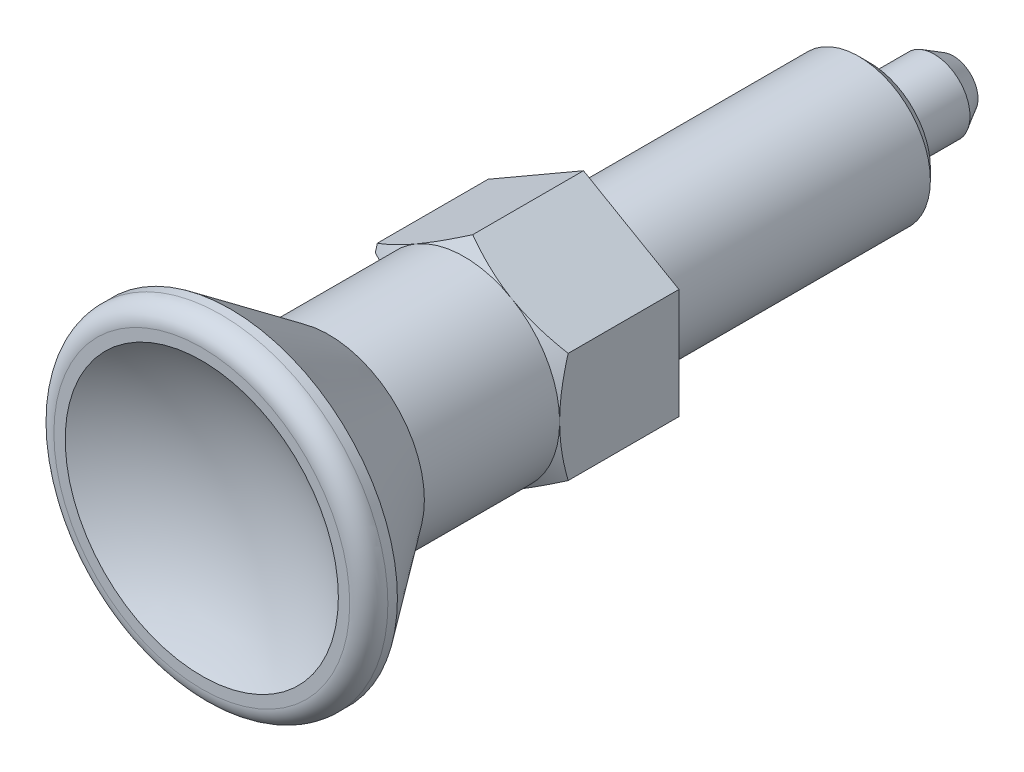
ISO-10303-21;
HEADER;
FILE_DESCRIPTION(('STEP AP214'),'2;1');
FILE_NAME('part.step','',(''),(''),'','','');
FILE_SCHEMA(('AUTOMOTIVE_DESIGN { 1 0 10303 214 1 1 1 1 }'));
ENDSEC;
DATA;
#1=APPLICATION_CONTEXT('core data for automotive mechanical design processes');
#2=APPLICATION_PROTOCOL_DEFINITION('international standard','automotive_design',2000,#1);
#3=PRODUCT_CONTEXT('',#1,'mechanical');
#4=PRODUCT('Part','Part','',(#3));
#5=PRODUCT_RELATED_PRODUCT_CATEGORY('part','',(#4));
#6=PRODUCT_DEFINITION_FORMATION('','',#4);
#7=PRODUCT_DEFINITION_CONTEXT('part definition',#1,'design');
#8=PRODUCT_DEFINITION('design','',#6,#7);
#9=PRODUCT_DEFINITION_SHAPE('','',#8);
#10=(LENGTH_UNIT() NAMED_UNIT(*) SI_UNIT(.MILLI.,.METRE.));
#11=(NAMED_UNIT(*) PLANE_ANGLE_UNIT() SI_UNIT($,.RADIAN.));
#12=(NAMED_UNIT(*) SI_UNIT($,.STERADIAN.) SOLID_ANGLE_UNIT());
#13=UNCERTAINTY_MEASURE_WITH_UNIT(LENGTH_MEASURE(1.E-05),#10,'distance_accuracy_value','');
#14=(GEOMETRIC_REPRESENTATION_CONTEXT(3) GLOBAL_UNCERTAINTY_ASSIGNED_CONTEXT((#13)) GLOBAL_UNIT_ASSIGNED_CONTEXT((#10,
#11,#12)) REPRESENTATION_CONTEXT('',''));
#15=CARTESIAN_POINT('',(0.,0.,0.));
#16=DIRECTION('',(0.,0.,1.));
#17=DIRECTION('',(1.,0.,0.));
#18=AXIS2_PLACEMENT_3D('',#15,#16,#17);
#19=CARTESIAN_POINT('',(-4.,2.30940107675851,5.));
#20=DIRECTION('',(1.,0.,0.));
#21=DIRECTION('',(0.,0.,-1.));
#22=AXIS2_PLACEMENT_3D('',#19,#20,#21);
#23=PLANE('',#22);
#24=DIRECTION('',(0.,-1.,0.));
#25=VECTOR('',#24,1.);
#26=CARTESIAN_POINT('',(-4.,-2.,0.8));
#27=LINE('',#26,#25);
#28=CARTESIAN_POINT('',(-4.,0.,0.8));
#29=VERTEX_POINT('',#28);
#30=CARTESIAN_POINT('',(-4.,-2.,0.8));
#31=VERTEX_POINT('',#30);
#32=EDGE_CURVE('E212',#29,#31,#27,.T.);
#33=ORIENTED_EDGE('',*,*,#32,.F.);
#34=DIRECTION('',(0.,-1.,0.));
#35=VECTOR('',#34,1.);
#36=CARTESIAN_POINT('',(-4.,2.,0.8));
#37=LINE('',#36,#35);
#38=CARTESIAN_POINT('',(-4.,2.,0.8));
#39=VERTEX_POINT('',#38);
#40=EDGE_CURVE('E206',#39,#29,#37,.T.);
#41=ORIENTED_EDGE('',*,*,#40,.F.);
#42=DIRECTION('',(0.,0.,-1.));
#43=VECTOR('',#42,1.);
#44=CARTESIAN_POINT('',(-4.,2.,5.));
#45=LINE('',#44,#43);
#46=CARTESIAN_POINT('',(-4.,2.,4.7274121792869));
#47=VERTEX_POINT('',#46);
#48=EDGE_CURVE('E209',#47,#39,#45,.T.);
#49=ORIENTED_EDGE('',*,*,#48,.F.);
#50=CARTESIAN_POINT('',(-4.,6.94219991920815,2.68359881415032));
#51=CARTESIAN_POINT('',(-4.,6.77603569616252,2.76670980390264));
#52=CARTESIAN_POINT('',(-4.,6.6095814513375,2.8492470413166));
#53=CARTESIAN_POINT('',(-4.,6.27596073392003,3.01289674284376));
#54=CARTESIAN_POINT('',(-4.,6.10879421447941,3.09400911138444));
#55=CARTESIAN_POINT('',(-4.,5.77330106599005,3.25468243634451));
#56=CARTESIAN_POINT('',(-4.,5.60497277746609,3.33423993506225));
#57=CARTESIAN_POINT('',(-4.,5.2673392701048,3.49124950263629));
#58=CARTESIAN_POINT('',(-4.,5.09803407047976,3.56870161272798));
#59=CARTESIAN_POINT('',(-4.,4.75061418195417,3.72444133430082));
#60=CARTESIAN_POINT('',(-4.,4.57244587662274,3.8026097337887));
#61=CARTESIAN_POINT('',(-4.,4.21459047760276,3.95538566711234));
#62=CARTESIAN_POINT('',(-4.,4.03490343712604,4.02999332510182));
#63=CARTESIAN_POINT('',(-4.,3.67381380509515,4.17464945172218));
#64=CARTESIAN_POINT('',(-4.,3.49241227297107,4.24470054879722));
#65=CARTESIAN_POINT('',(-4.,3.12748949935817,4.37901752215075));
#66=CARTESIAN_POINT('',(-4.,2.94396849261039,4.44328403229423));
#67=CARTESIAN_POINT('',(-4.,2.53114564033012,4.5786268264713));
#68=CARTESIAN_POINT('',(-4.,2.30119910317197,4.64776652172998));
#69=CARTESIAN_POINT('',(-4.,1.83716013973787,4.77084277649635));
#70=CARTESIAN_POINT('',(-4.,1.60306808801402,4.8247807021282));
#71=CARTESIAN_POINT('',(-4.,1.25115476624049,4.89049433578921));
#72=CARTESIAN_POINT('',(-4.,1.13472020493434,4.90976469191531));
#73=CARTESIAN_POINT('',(-4.,0.901105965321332,4.94302626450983));
#74=CARTESIAN_POINT('',(-4.,0.783926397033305,4.95701824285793));
#75=CARTESIAN_POINT('',(-4.,0.549056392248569,4.97930439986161));
#76=CARTESIAN_POINT('',(-4.,0.43136611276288,4.98760021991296));
#77=CARTESIAN_POINT('',(-4.,0.195714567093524,4.99823203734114));
#78=CARTESIAN_POINT('',(-4.,0.0777533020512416,5.00056805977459));
#79=CARTESIAN_POINT('',(-4.,-0.158841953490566,4.99919469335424));
#80=CARTESIAN_POINT('',(-4.,-0.277475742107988,4.99544901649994));
#81=CARTESIAN_POINT('',(-4.,-0.514393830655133,4.98197915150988));
#82=CARTESIAN_POINT('',(-4.,-0.632678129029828,4.97225493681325));
#83=CARTESIAN_POINT('',(-4.,-0.986685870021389,4.93453988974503));
#84=CARTESIAN_POINT('',(-4.,-1.22152848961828,4.89800700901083));
#85=CARTESIAN_POINT('',(-4.,-1.69131615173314,4.80535547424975));
#86=CARTESIAN_POINT('',(-4.,-1.92619462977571,4.74891340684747));
#87=CARTESIAN_POINT('',(-4.,-2.39194540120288,4.62119578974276));
#88=CARTESIAN_POINT('',(-4.,-2.62281536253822,4.549911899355));
#89=CARTESIAN_POINT('',(-4.,-3.03218850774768,4.41269957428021));
#90=CARTESIAN_POINT('',(-4.,-3.21140125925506,4.34884828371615));
#91=CARTESIAN_POINT('',(-4.,-3.56777859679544,4.21582911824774));
#92=CARTESIAN_POINT('',(-4.,-3.74494373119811,4.14666270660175));
#93=CARTESIAN_POINT('',(-4.,-4.09769114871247,4.00409177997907));
#94=CARTESIAN_POINT('',(-4.,-4.27327226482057,3.93068439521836));
#95=CARTESIAN_POINT('',(-4.,-4.62300750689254,3.78054235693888));
#96=CARTESIAN_POINT('',(-4.,-4.79716158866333,3.70380760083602));
#97=CARTESIAN_POINT('',(-4.,-5.13693923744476,3.55097532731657));
#98=CARTESIAN_POINT('',(-4.,-5.30261242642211,3.47498778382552));
#99=CARTESIAN_POINT('',(-4.,-5.63302677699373,3.32102277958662));
#100=CARTESIAN_POINT('',(-4.,-5.7977679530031,3.24304534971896));
#101=CARTESIAN_POINT('',(-4.,-6.12617341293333,3.08559440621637));
#102=CARTESIAN_POINT('',(-4.,-6.28983908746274,3.00612378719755));
#103=CARTESIAN_POINT('',(-4.,-6.61649594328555,2.84581872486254));
#104=CARTESIAN_POINT('',(-4.,-6.77948714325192,2.76498431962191));
#105=CARTESIAN_POINT('',(-4.,-6.94219991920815,2.68359881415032));
#106=B_SPLINE_CURVE_WITH_KNOTS('',3,(#50,#51,#52,#53,#54,#55,#56,#57,#58,#59,#60,#61,#62,#63,
#64,#65,#66,#67,#68,#69,#70,#71,#72,#73,#74,#75,#76,#77,#78,#79,#80,#81,#82,#83,#84,#85,#86,#87,
#88,#89,#90,#91,#92,#93,#94,#95,#96,#97,#98,#99,#100,#101,#102,#103,#104,#105),.UNSPECIFIED.,
.F.,.F.,(4,2,2,2,2,2,2,2,2,2,2,2,2,2,2,2,2,2,2,2,2,2,2,2,2,2,2,4),(0.,0.557373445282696,
1.11478413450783,1.67331868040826,2.23184227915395,2.81549662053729,3.39913059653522,
3.98242486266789,4.56565513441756,5.28563913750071,6.00555841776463,6.35951289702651,
6.71341626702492,7.06721761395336,7.42101747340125,7.77693613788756,8.13285638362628,
8.84480341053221,9.56889286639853,10.2933903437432,10.8640406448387,11.4345344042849,
12.005418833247,12.5763208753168,13.123110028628,13.6698907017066,14.215702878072,
14.7614998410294),.UNSPECIFIED.);
#107=CARTESIAN_POINT('',(-4.,2.30940107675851,4.64273441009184));
#108=VERTEX_POINT('',#107);
#109=EDGE_CURVE('E774',#108,#47,#106,.T.);
#110=ORIENTED_EDGE('',*,*,#109,.F.);
#111=DIRECTION('',(0.,0.,-1.));
#112=VECTOR('',#111,1.);
#113=CARTESIAN_POINT('',(-4.,2.30940107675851,5.));
#114=LINE('',#113,#112);
#115=CARTESIAN_POINT('',(-4.,2.30940107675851,0.));
#116=VERTEX_POINT('',#115);
#117=EDGE_CURVE('E735',#108,#116,#114,.T.);
#118=ORIENTED_EDGE('',*,*,#117,.T.);
#119=DIRECTION('',(0.,-1.,0.));
#120=VECTOR('',#119,1.);
#121=CARTESIAN_POINT('',(-4.,2.30940107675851,0.));
#122=LINE('',#121,#120);
#123=CARTESIAN_POINT('',(-4.,-2.30940107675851,0.));
#124=VERTEX_POINT('',#123);
#125=EDGE_CURVE('E706',#116,#124,#122,.T.);
#126=ORIENTED_EDGE('',*,*,#125,.T.);
#127=DIRECTION('',(0.,0.,-1.));
#128=VECTOR('',#127,1.);
#129=CARTESIAN_POINT('',(-4.,-2.30940107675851,5.));
#130=LINE('',#129,#128);
#131=CARTESIAN_POINT('',(-4.,-2.30940107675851,4.64273441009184));
#132=VERTEX_POINT('',#131);
#133=EDGE_CURVE('E732',#132,#124,#130,.T.);
#134=ORIENTED_EDGE('',*,*,#133,.F.);
#135=CARTESIAN_POINT('',(-4.,-2.,4.7274121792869));
#136=VERTEX_POINT('',#135);
#137=EDGE_CURVE('E292',#136,#132,#106,.T.);
#138=ORIENTED_EDGE('',*,*,#137,.F.);
#139=DIRECTION('',(0.,0.,1.));
#140=VECTOR('',#139,1.);
#141=CARTESIAN_POINT('',(-4.,-2.,5.));
#142=LINE('',#141,#140);
#143=EDGE_CURVE('E792',#31,#136,#142,.T.);
#144=ORIENTED_EDGE('',*,*,#143,.F.);
#145=EDGE_LOOP('',(#33,#41,#49,#110,#118,#126,#134,#138,#144));
#146=FACE_BOUND('',#145,.T.);
#147=ADVANCED_FACE('F16',(#146),#23,.F.);
#148=CARTESIAN_POINT('',(0.,0.,5.));
#149=DIRECTION('',(0.,0.,-1.));
#150=DIRECTION('',(-1.,0.,0.));
#151=AXIS2_PLACEMENT_3D('',#148,#149,#150);
#152=CONICAL_SURFACE('',#151,4.,1.0471975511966);
#153=CARTESIAN_POINT('',(-5.63960193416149,-2.,3.85468883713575));
#154=CARTESIAN_POINT('',(-5.44305552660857,-2.,3.96160040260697));
#155=CARTESIAN_POINT('',(-5.24627466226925,-2.,4.0680876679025));
#156=CARTESIAN_POINT('',(-4.85207699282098,-2.,4.27970429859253));
#157=CARTESIAN_POINT('',(-4.65466044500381,-2.,4.38483414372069));
#158=CARTESIAN_POINT('',(-4.25951074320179,-2.,4.59297377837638));
#159=CARTESIAN_POINT('',(-4.06178058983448,-2.,4.69598924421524));
#160=CARTESIAN_POINT('',(-3.66490811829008,-2.,4.89947675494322));
#161=CARTESIAN_POINT('',(-3.46576524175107,-2.,4.99994771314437));
#162=CARTESIAN_POINT('',(-3.0646119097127,-2.,5.19747364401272));
#163=CARTESIAN_POINT('',(-2.86259239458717,-2.,5.2945104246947));
#164=CARTESIAN_POINT('',(-2.55746435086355,-2.,5.43528371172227));
#165=CARTESIAN_POINT('',(-2.45545220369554,-2.,5.4813912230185));
#166=CARTESIAN_POINT('',(-2.25052354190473,-2.,5.57154461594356));
#167=CARTESIAN_POINT('',(-2.14760707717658,-2.,5.61559061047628));
#168=CARTESIAN_POINT('',(-1.94022174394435,-2.,5.70117457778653));
#169=CARTESIAN_POINT('',(-1.83574816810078,-2.,5.74270122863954));
#170=CARTESIAN_POINT('',(-1.62547380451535,-2.,5.82213860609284));
#171=CARTESIAN_POINT('',(-1.51967355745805,-2.,5.86005075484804));
#172=CARTESIAN_POINT('',(-1.3060831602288,-2.,5.93121414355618));
#173=CARTESIAN_POINT('',(-1.19828749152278,-2.,5.9644491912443));
#174=CARTESIAN_POINT('',(-0.980778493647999,-2.,6.02450323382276));
#175=CARTESIAN_POINT('',(-0.871062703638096,-2.,6.05131323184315));
#176=CARTESIAN_POINT('',(-0.760398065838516,-2.,6.07405966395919));
#177=B_SPLINE_CURVE_WITH_KNOTS('',3,(#153,#154,#155,#156,#157,#158,#159,#160,#161,#162,#163,
#164,#165,#166,#167,#168,#169,#170,#171,#172,#173,#174,#175,#176),.UNSPECIFIED.,.F.,.F.,(4,2,2,
2,2,2,2,2,2,2,2,4),(0.,0.671230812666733,1.34221752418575,2.01107158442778,2.68020663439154,
3.35247394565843,3.68830146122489,4.02411056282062,4.36133137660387,4.69841895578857,
5.036646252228,5.37534442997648),.UNSPECIFIED.);
#178=CARTESIAN_POINT('',(-3.46410161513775,-2.,5.));
#179=VERTEX_POINT('',#178);
#180=EDGE_CURVE('E10',#136,#179,#177,.T.);
#181=ORIENTED_EDGE('',*,*,#180,.F.);
#182=ORIENTED_EDGE('',*,*,#137,.T.);
#183=CARTESIAN_POINT('',(-4.0002,-2.30928560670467,4.64266774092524));
#184=CARTESIAN_POINT('',(-3.82442084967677,-2.41077174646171,4.70128212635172));
#185=CARTESIAN_POINT('',(-3.64712438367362,-2.513133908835,4.75458967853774));
#186=CARTESIAN_POINT('',(-3.28946140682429,-2.71963072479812,4.84763832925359));
#187=CARTESIAN_POINT('',(-3.10908854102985,-2.82376904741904,4.8873465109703));
#188=CARTESIAN_POINT('',(-2.75057818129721,-3.03075510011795,4.94915778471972));
#189=CARTESIAN_POINT('',(-2.57249584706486,-3.13357098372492,4.97167226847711));
#190=CARTESIAN_POINT('',(-2.2154932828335,-3.33968651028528,4.99854937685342));
#191=CARTESIAN_POINT('',(-2.0365743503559,-3.44298540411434,5.00293425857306));
#192=CARTESIAN_POINT('',(-1.70225715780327,-3.63600352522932,4.99380992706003));
#193=CARTESIAN_POINT('',(-1.54680884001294,-3.72575165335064,4.98254104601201));
#194=CARTESIAN_POINT('',(-1.23692494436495,-3.90466320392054,4.94682600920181));
#195=CARTESIAN_POINT('',(-1.08249043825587,-3.99382600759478,4.92236765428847));
#196=CARTESIAN_POINT('',(-0.771967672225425,-4.17310641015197,4.86122393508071));
#197=CARTESIAN_POINT('',(-0.6159187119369,-4.26320131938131,4.82427939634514));
#198=CARTESIAN_POINT('',(-0.306148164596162,-4.4420474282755,4.74042992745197));
#199=CARTESIAN_POINT('',(-0.152422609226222,-4.53080091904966,4.69354469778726));
#200=CARTESIAN_POINT('',(0.000199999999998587,-4.61891762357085,4.64266774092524));
#201=B_SPLINE_CURVE_WITH_KNOTS('',3,(#183,#184,#185,#186,#187,#188,#189,#190,#191,#192,#193,
#194,#195,#196,#197,#198,#199,#200),.UNSPECIFIED.,.F.,.F.,(4,2,2,2,2,2,2,2,4),(0.,
0.634047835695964,1.26961969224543,1.88946157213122,2.50854226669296,3.04757825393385,
3.58711366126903,4.13861653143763,4.68903648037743),.UNSPECIFIED.);
#202=CARTESIAN_POINT('',(-2.,-3.46410161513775,5.));
#203=VERTEX_POINT('',#202);
#204=EDGE_CURVE('E778',#132,#203,#201,.T.);
#205=ORIENTED_EDGE('',*,*,#204,.T.);
#206=CARTESIAN_POINT('',(0.,0.,5.));
#207=DIRECTION('',(0.,0.,1.));
#208=DIRECTION('',(1.,0.,0.));
#209=AXIS2_PLACEMENT_3D('',#206,#207,#208);
#210=CIRCLE('',#209,4.);
#211=EDGE_CURVE('E751',#179,#203,#210,.T.);
#212=ORIENTED_EDGE('',*,*,#211,.F.);
#213=EDGE_LOOP('',(#181,#182,#205,#212));
#214=FACE_BOUND('',#213,.T.);
#215=ADVANCED_FACE('F275',(#214),#152,.T.);
#216=CARTESIAN_POINT('',(-0.760398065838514,2.,6.07405966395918));
#217=CARTESIAN_POINT('',(-0.852479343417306,2.,6.05515117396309));
#218=CARTESIAN_POINT('',(-0.943918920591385,2.,6.03340322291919));
#219=CARTESIAN_POINT('',(-1.12547581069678,2.,5.98524543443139));
#220=CARTESIAN_POINT('',(-1.21559432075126,2.,5.95884014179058));
#221=CARTESIAN_POINT('',(-1.39438815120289,2.,5.9024263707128));
#222=CARTESIAN_POINT('',(-1.48306690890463,2.,5.87242860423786));
#223=CARTESIAN_POINT('',(-1.65940941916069,2.,5.80952958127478));
#224=CARTESIAN_POINT('',(-1.74707288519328,2.,5.77662752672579));
#225=CARTESIAN_POINT('',(-2.00804397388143,2.,5.67480303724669));
#226=CARTESIAN_POINT('',(-2.18003823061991,2.,5.60252807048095));
#227=CARTESIAN_POINT('',(-2.52166053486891,2.,5.45228888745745));
#228=CARTESIAN_POINT('',(-2.69128630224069,2.,5.37431958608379));
#229=CARTESIAN_POINT('',(-2.97769282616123,2.,5.23880174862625));
#230=CARTESIAN_POINT('',(-3.09493070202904,2.,5.18221419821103));
#231=CARTESIAN_POINT('',(-3.3287174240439,2.,5.06763479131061));
#232=CARTESIAN_POINT('',(-3.44526626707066,2.,5.009642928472));
#233=CARTESIAN_POINT('',(-3.79401368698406,2.,4.83409044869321));
#234=CARTESIAN_POINT('',(-4.02539708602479,2.,4.71491262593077));
#235=CARTESIAN_POINT('',(-4.48779393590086,2.,4.47328422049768));
#236=CARTESIAN_POINT('',(-4.71880080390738,2.,4.35082111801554));
#237=CARTESIAN_POINT('',(-5.06458306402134,2.,4.16572193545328));
#238=CARTESIAN_POINT('',(-5.1797323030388,2.,4.10378275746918));
#239=CARTESIAN_POINT('',(-5.40981749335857,2.,3.97951214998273));
#240=CARTESIAN_POINT('',(-5.52475344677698,2.,3.91718072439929));
#241=CARTESIAN_POINT('',(-5.63960193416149,2.,3.85468883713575));
#242=B_SPLINE_CURVE_WITH_KNOTS('',3,(#216,#217,#218,#219,#220,#221,#222,#223,#224,#225,#226,
#227,#228,#229,#230,#231,#232,#233,#234,#235,#236,#237,#238,#239,#240,#241),.UNSPECIFIED.,.F.,
.F.,(4,2,2,2,2,2,2,2,2,2,2,2,4),(0.,0.281880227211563,0.563486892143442,0.844273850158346,
1.12513820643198,1.68463880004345,2.24464529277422,2.63517472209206,3.02570591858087,
3.8064890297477,4.59085905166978,4.98311122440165,5.37535948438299),.UNSPECIFIED.);
#243=CARTESIAN_POINT('',(-3.46410161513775,2.,5.));
#244=VERTEX_POINT('',#243);
#245=EDGE_CURVE('E31',#244,#47,#242,.T.);
#246=ORIENTED_EDGE('',*,*,#245,.F.);
#247=CARTESIAN_POINT('',(-2.,3.46410161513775,5.));
#248=VERTEX_POINT('',#247);
#249=EDGE_CURVE('E431',#248,#244,#210,.T.);
#250=ORIENTED_EDGE('',*,*,#249,.F.);
#251=CARTESIAN_POINT('',(0.0002000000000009,4.61891762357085,4.64266774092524));
#252=CARTESIAN_POINT('',(-0.175579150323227,4.51743148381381,4.70128212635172));
#253=CARTESIAN_POINT('',(-0.35287561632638,4.41506932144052,4.75458967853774));
#254=CARTESIAN_POINT('',(-0.710538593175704,4.2085725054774,4.84763832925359));
#255=CARTESIAN_POINT('',(-0.890911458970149,4.10443418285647,4.88734651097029));
#256=CARTESIAN_POINT('',(-1.24942181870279,3.89744813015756,4.94915778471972));
#257=CARTESIAN_POINT('',(-1.42750415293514,3.7946322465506,4.97167226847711));
#258=CARTESIAN_POINT('',(-1.78450671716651,3.58851671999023,4.99854937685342));
#259=CARTESIAN_POINT('',(-1.9634256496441,3.48521782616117,5.00293425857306));
#260=CARTESIAN_POINT('',(-2.29774284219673,3.29219970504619,4.99380992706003));
#261=CARTESIAN_POINT('',(-2.45319115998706,3.20245157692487,4.98254104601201));
#262=CARTESIAN_POINT('',(-2.76307505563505,3.02354002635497,4.94682600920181));
#263=CARTESIAN_POINT('',(-2.91750956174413,2.93437722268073,4.92236765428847));
#264=CARTESIAN_POINT('',(-3.22803232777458,2.75509682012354,4.86122393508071));
#265=CARTESIAN_POINT('',(-3.3840812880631,2.6650019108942,4.82427939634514));
#266=CARTESIAN_POINT('',(-3.69385183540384,2.48615580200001,4.74042992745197));
#267=CARTESIAN_POINT('',(-3.84757739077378,2.39740231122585,4.69354469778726));
#268=CARTESIAN_POINT('',(-4.0002,2.30928560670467,4.64266774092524));
#269=B_SPLINE_CURVE_WITH_KNOTS('',3,(#251,#252,#253,#254,#255,#256,#257,#258,#259,#260,#261,
#262,#263,#264,#265,#266,#267,#268),.UNSPECIFIED.,.F.,.F.,(4,2,2,2,2,2,2,2,4),(0.,
0.634047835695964,1.26961969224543,1.88946157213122,2.50854226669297,3.04757825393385,
3.58711366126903,4.13861653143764,4.68903648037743),.UNSPECIFIED.);
#270=EDGE_CURVE('E300',#248,#108,#269,.T.);
#271=ORIENTED_EDGE('',*,*,#270,.T.);
#272=ORIENTED_EDGE('',*,*,#109,.T.);
#273=EDGE_LOOP('',(#246,#250,#271,#272));
#274=FACE_BOUND('',#273,.T.);
#275=ADVANCED_FACE('F377',(#274),#152,.T.);
#276=CARTESIAN_POINT('',(4.,2.30940107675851,5.));
#277=DIRECTION('',(-0.5,-0.866025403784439,0.));
#278=DIRECTION('',(0.866025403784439,-0.5,0.));
#279=AXIS2_PLACEMENT_3D('',#276,#277,#278);
#280=PLANE('',#279);
#281=CARTESIAN_POINT('',(4.0002,2.30928560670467,4.64266774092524));
#282=CARTESIAN_POINT('',(3.82442084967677,2.41077174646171,4.70128212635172));
#283=CARTESIAN_POINT('',(3.64712438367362,2.513133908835,4.75458967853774));
#284=CARTESIAN_POINT('',(3.28946140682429,2.71963072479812,4.84763832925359));
#285=CARTESIAN_POINT('',(3.10908854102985,2.82376904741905,4.8873465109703));
#286=CARTESIAN_POINT('',(2.75057818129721,3.03075510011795,4.94915778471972));
#287=CARTESIAN_POINT('',(2.57249584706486,3.13357098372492,4.97167226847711));
#288=CARTESIAN_POINT('',(2.21549328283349,3.33968651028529,4.99854937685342));
#289=CARTESIAN_POINT('',(2.0365743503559,3.44298540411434,5.00293425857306));
#290=CARTESIAN_POINT('',(1.70225715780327,3.63600352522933,4.99380992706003));
#291=CARTESIAN_POINT('',(1.54680884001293,3.72575165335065,4.98254104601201));
#292=CARTESIAN_POINT('',(1.23692494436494,3.90466320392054,4.94682600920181));
#293=CARTESIAN_POINT('',(1.08249043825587,3.99382600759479,4.92236765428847));
#294=CARTESIAN_POINT('',(0.771967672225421,4.17310641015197,4.86122393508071));
#295=CARTESIAN_POINT('',(0.615918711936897,4.26320131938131,4.82427939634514));
#296=CARTESIAN_POINT('',(0.30614816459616,4.44204742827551,4.74042992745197));
#297=CARTESIAN_POINT('',(0.152422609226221,4.53080091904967,4.69354469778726));
#298=CARTESIAN_POINT('',(-0.000199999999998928,4.61891762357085,4.64266774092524));
#299=B_SPLINE_CURVE_WITH_KNOTS('',3,(#281,#282,#283,#284,#285,#286,#287,#288,#289,#290,#291,
#292,#293,#294,#295,#296,#297,#298),.UNSPECIFIED.,.F.,.F.,(4,2,2,2,2,2,2,2,4),(0.,
0.634047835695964,1.26961969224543,1.88946157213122,2.50854226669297,3.04757825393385,
3.58711366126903,4.13861653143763,4.68903648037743),.UNSPECIFIED.);
#300=CARTESIAN_POINT('',(4.,2.30940107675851,4.64273441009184));
#301=VERTEX_POINT('',#300);
#302=CARTESIAN_POINT('',(2.,3.46410161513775,5.));
#303=VERTEX_POINT('',#302);
#304=EDGE_CURVE('E704',#301,#303,#299,.T.);
#305=ORIENTED_EDGE('',*,*,#304,.F.);
#306=DIRECTION('',(0.,0.,-1.));
#307=VECTOR('',#306,1.);
#308=CARTESIAN_POINT('',(4.,2.30940107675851,5.));
#309=LINE('',#308,#307);
#310=CARTESIAN_POINT('',(4.,2.30940107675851,0.));
#311=VERTEX_POINT('',#310);
#312=EDGE_CURVE('E724',#301,#311,#309,.T.);
#313=ORIENTED_EDGE('',*,*,#312,.T.);
#314=DIRECTION('',(-0.866025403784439,0.5,0.));
#315=VECTOR('',#314,1.);
#316=CARTESIAN_POINT('',(4.,2.30940107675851,0.));
#317=LINE('',#316,#315);
#318=CARTESIAN_POINT('',(0.,4.61880215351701,0.));
#319=VERTEX_POINT('',#318);
#320=EDGE_CURVE('E695',#311,#319,#317,.T.);
#321=ORIENTED_EDGE('',*,*,#320,.T.);
#322=DIRECTION('',(0.,0.,-1.));
#323=VECTOR('',#322,1.);
#324=CARTESIAN_POINT('',(0.,4.61880215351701,5.));
#325=LINE('',#324,#323);
#326=CARTESIAN_POINT('',(0.,4.61880215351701,4.64273441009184));
#327=VERTEX_POINT('',#326);
#328=EDGE_CURVE('E738',#327,#319,#325,.T.);
#329=ORIENTED_EDGE('',*,*,#328,.F.);
#330=EDGE_CURVE('E307',#303,#327,#299,.T.);
#331=ORIENTED_EDGE('',*,*,#330,.F.);
#332=EDGE_LOOP('',(#305,#313,#321,#329,#331));
#333=FACE_BOUND('',#332,.T.);
#334=ADVANCED_FACE('F386',(#333),#280,.F.);
#335=CARTESIAN_POINT('',(0.,4.61880215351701,5.));
#336=DIRECTION('',(0.5,-0.866025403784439,0.));
#337=DIRECTION('',(0.866025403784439,0.5,0.));
#338=AXIS2_PLACEMENT_3D('',#335,#336,#337);
#339=PLANE('',#338);
#340=EDGE_CURVE('E772',#327,#248,#269,.T.);
#341=ORIENTED_EDGE('',*,*,#340,.F.);
#342=ORIENTED_EDGE('',*,*,#328,.T.);
#343=DIRECTION('',(-0.866025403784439,-0.5,0.));
#344=VECTOR('',#343,1.);
#345=CARTESIAN_POINT('',(0.,4.61880215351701,0.));
#346=LINE('',#345,#344);
#347=EDGE_CURVE('E701',#319,#116,#346,.T.);
#348=ORIENTED_EDGE('',*,*,#347,.T.);
#349=ORIENTED_EDGE('',*,*,#117,.F.);
#350=ORIENTED_EDGE('',*,*,#270,.F.);
#351=EDGE_LOOP('',(#341,#342,#348,#349,#350));
#352=FACE_BOUND('',#351,.T.);
#353=ADVANCED_FACE('F383',(#352),#339,.F.);
#354=CARTESIAN_POINT('',(-4.,-2.30940107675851,5.));
#355=DIRECTION('',(0.5,0.866025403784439,0.));
#356=DIRECTION('',(-0.866025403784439,0.5,0.));
#357=AXIS2_PLACEMENT_3D('',#354,#355,#356);
#358=PLANE('',#357);
#359=ORIENTED_EDGE('',*,*,#204,.F.);
#360=ORIENTED_EDGE('',*,*,#133,.T.);
#361=DIRECTION('',(0.866025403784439,-0.5,0.));
#362=VECTOR('',#361,1.);
#363=CARTESIAN_POINT('',(-4.,-2.30940107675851,0.));
#364=LINE('',#363,#362);
#365=CARTESIAN_POINT('',(0.,-4.61880215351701,0.));
#366=VERTEX_POINT('',#365);
#367=EDGE_CURVE('E714',#124,#366,#364,.T.);
#368=ORIENTED_EDGE('',*,*,#367,.T.);
#369=DIRECTION('',(0.,0.,-1.));
#370=VECTOR('',#369,1.);
#371=CARTESIAN_POINT('',(0.,-4.61880215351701,5.));
#372=LINE('',#371,#370);
#373=CARTESIAN_POINT('',(0.,-4.61880215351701,4.64273441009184));
#374=VERTEX_POINT('',#373);
#375=EDGE_CURVE('E729',#374,#366,#372,.T.);
#376=ORIENTED_EDGE('',*,*,#375,.F.);
#377=EDGE_CURVE('E284',#203,#374,#201,.T.);
#378=ORIENTED_EDGE('',*,*,#377,.F.);
#379=EDGE_LOOP('',(#359,#360,#368,#376,#378));
#380=FACE_BOUND('',#379,.T.);
#381=ADVANCED_FACE('F381',(#380),#358,.F.);
#382=CARTESIAN_POINT('',(0.,-4.61880215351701,5.));
#383=DIRECTION('',(-0.5,0.866025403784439,0.));
#384=DIRECTION('',(-0.866025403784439,-0.5,0.));
#385=AXIS2_PLACEMENT_3D('',#382,#383,#384);
#386=PLANE('',#385);
#387=CARTESIAN_POINT('',(-0.000200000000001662,-4.61891762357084,4.64266774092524));
#388=CARTESIAN_POINT('',(0.175579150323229,-4.5174314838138,4.70128212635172));
#389=CARTESIAN_POINT('',(0.352875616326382,-4.41506932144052,4.75458967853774));
#390=CARTESIAN_POINT('',(0.710538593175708,-4.2085725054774,4.84763832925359));
#391=CARTESIAN_POINT('',(0.890911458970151,-4.10443418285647,4.88734651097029));
#392=CARTESIAN_POINT('',(1.24942181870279,-3.89744813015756,4.94915778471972));
#393=CARTESIAN_POINT('',(1.42750415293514,-3.7946322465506,4.97167226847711));
#394=CARTESIAN_POINT('',(1.78450671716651,-3.58851671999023,4.99854937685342));
#395=CARTESIAN_POINT('',(1.9634256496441,-3.48521782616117,5.00293425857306));
#396=CARTESIAN_POINT('',(2.29774284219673,-3.29219970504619,4.99380992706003));
#397=CARTESIAN_POINT('',(2.45319115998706,-3.20245157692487,4.98254104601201));
#398=CARTESIAN_POINT('',(2.76307505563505,-3.02354002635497,4.94682600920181));
#399=CARTESIAN_POINT('',(2.91750956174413,-2.93437722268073,4.92236765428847));
#400=CARTESIAN_POINT('',(3.22803232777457,-2.75509682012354,4.86122393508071));
#401=CARTESIAN_POINT('',(3.3840812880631,-2.6650019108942,4.82427939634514));
#402=CARTESIAN_POINT('',(3.69385183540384,-2.48615580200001,4.74042992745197));
#403=CARTESIAN_POINT('',(3.84757739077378,-2.39740231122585,4.69354469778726));
#404=CARTESIAN_POINT('',(4.0002,-2.30928560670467,4.64266774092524));
#405=B_SPLINE_CURVE_WITH_KNOTS('',3,(#387,#388,#389,#390,#391,#392,#393,#394,#395,#396,#397,
#398,#399,#400,#401,#402,#403,#404),.UNSPECIFIED.,.F.,.F.,(4,2,2,2,2,2,2,2,4),(0.,
0.634047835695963,1.26961969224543,1.88946157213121,2.50854226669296,3.04757825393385,
3.58711366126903,4.13861653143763,4.68903648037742),.UNSPECIFIED.);
#406=CARTESIAN_POINT('',(2.,-3.46410161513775,5.));
#407=VERTEX_POINT('',#406);
#408=EDGE_CURVE('E783',#374,#407,#405,.T.);
#409=ORIENTED_EDGE('',*,*,#408,.F.);
#410=ORIENTED_EDGE('',*,*,#375,.T.);
#411=DIRECTION('',(0.866025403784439,0.5,0.));
#412=VECTOR('',#411,1.);
#413=CARTESIAN_POINT('',(0.,-4.61880215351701,0.));
#414=LINE('',#413,#412);
#415=CARTESIAN_POINT('',(4.,-2.30940107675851,0.));
#416=VERTEX_POINT('',#415);
#417=EDGE_CURVE('E718',#366,#416,#414,.T.);
#418=ORIENTED_EDGE('',*,*,#417,.T.);
#419=DIRECTION('',(0.,0.,-1.));
#420=VECTOR('',#419,1.);
#421=CARTESIAN_POINT('',(4.,-2.30940107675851,5.));
#422=LINE('',#421,#420);
#423=CARTESIAN_POINT('',(4.,-2.30940107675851,4.64273441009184));
#424=VERTEX_POINT('',#423);
#425=EDGE_CURVE('E726',#424,#416,#422,.T.);
#426=ORIENTED_EDGE('',*,*,#425,.F.);
#427=EDGE_CURVE('E258',#407,#424,#405,.T.);
#428=ORIENTED_EDGE('',*,*,#427,.F.);
#429=EDGE_LOOP('',(#409,#410,#418,#426,#428));
#430=FACE_BOUND('',#429,.T.);
#431=ADVANCED_FACE('F576',(#430),#386,.F.);
#432=CARTESIAN_POINT('',(4.,-2.30940107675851,5.));
#433=DIRECTION('',(-1.,0.,0.));
#434=DIRECTION('',(0.,0.,1.));
#435=AXIS2_PLACEMENT_3D('',#432,#433,#434);
#436=PLANE('',#435);
#437=CARTESIAN_POINT('',(4.,-6.94219991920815,2.68359881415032));
#438=CARTESIAN_POINT('',(4.,-6.77603569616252,2.76670980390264));
#439=CARTESIAN_POINT('',(4.,-6.6095814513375,2.8492470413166));
#440=CARTESIAN_POINT('',(4.,-6.27596073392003,3.01289674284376));
#441=CARTESIAN_POINT('',(4.,-6.10879421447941,3.09400911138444));
#442=CARTESIAN_POINT('',(4.,-5.77330106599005,3.25468243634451));
#443=CARTESIAN_POINT('',(4.,-5.60497277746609,3.33423993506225));
#444=CARTESIAN_POINT('',(4.,-5.2673392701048,3.49124950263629));
#445=CARTESIAN_POINT('',(4.,-5.09803407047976,3.56870161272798));
#446=CARTESIAN_POINT('',(4.,-4.75061418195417,3.72444133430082));
#447=CARTESIAN_POINT('',(4.,-4.57244587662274,3.80260973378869));
#448=CARTESIAN_POINT('',(4.,-4.21459047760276,3.95538566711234));
#449=CARTESIAN_POINT('',(4.,-4.03490343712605,4.02999332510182));
#450=CARTESIAN_POINT('',(4.,-3.67381380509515,4.17464945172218));
#451=CARTESIAN_POINT('',(4.,-3.49241227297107,4.24470054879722));
#452=CARTESIAN_POINT('',(4.,-3.12748949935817,4.37901752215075));
#453=CARTESIAN_POINT('',(4.,-2.94396849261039,4.44328403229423));
#454=CARTESIAN_POINT('',(4.,-2.53114564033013,4.5786268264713));
#455=CARTESIAN_POINT('',(4.,-2.30119910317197,4.64776652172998));
#456=CARTESIAN_POINT('',(4.,-1.83716013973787,4.77084277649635));
#457=CARTESIAN_POINT('',(4.,-1.60306808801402,4.8247807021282));
#458=CARTESIAN_POINT('',(4.,-1.2511547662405,4.89049433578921));
#459=CARTESIAN_POINT('',(4.,-1.13472020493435,4.90976469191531));
#460=CARTESIAN_POINT('',(4.,-0.901105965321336,4.94302626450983));
#461=CARTESIAN_POINT('',(4.,-0.783926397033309,4.95701824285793));
#462=CARTESIAN_POINT('',(4.,-0.549056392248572,4.97930439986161));
#463=CARTESIAN_POINT('',(4.,-0.431366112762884,4.98760021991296));
#464=CARTESIAN_POINT('',(4.,-0.195714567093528,4.99823203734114));
#465=CARTESIAN_POINT('',(4.,-0.077753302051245,5.00056805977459));
#466=CARTESIAN_POINT('',(4.,0.158841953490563,4.99919469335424));
#467=CARTESIAN_POINT('',(4.,0.277475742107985,4.99544901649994));
#468=CARTESIAN_POINT('',(4.,0.514393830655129,4.98197915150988));
#469=CARTESIAN_POINT('',(4.,0.632678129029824,4.97225493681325));
#470=CARTESIAN_POINT('',(4.,0.986685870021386,4.93453988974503));
#471=CARTESIAN_POINT('',(4.,1.22152848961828,4.89800700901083));
#472=CARTESIAN_POINT('',(4.,1.69131615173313,4.80535547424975));
#473=CARTESIAN_POINT('',(4.,1.9261946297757,4.74891340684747));
#474=CARTESIAN_POINT('',(4.,2.39194540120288,4.62119578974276));
#475=CARTESIAN_POINT('',(4.,2.62281536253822,4.549911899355));
#476=CARTESIAN_POINT('',(4.,3.03218850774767,4.41269957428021));
#477=CARTESIAN_POINT('',(4.,3.21140125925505,4.34884828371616));
#478=CARTESIAN_POINT('',(4.,3.56777859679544,4.21582911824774));
#479=CARTESIAN_POINT('',(4.,3.74494373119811,4.14666270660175));
#480=CARTESIAN_POINT('',(4.,4.09769114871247,4.00409177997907));
#481=CARTESIAN_POINT('',(4.,4.27327226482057,3.93068439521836));
#482=CARTESIAN_POINT('',(4.,4.62300750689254,3.78054235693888));
#483=CARTESIAN_POINT('',(4.,4.79716158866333,3.70380760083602));
#484=CARTESIAN_POINT('',(4.,5.13693923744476,3.55097532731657));
#485=CARTESIAN_POINT('',(4.,5.3026124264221,3.47498778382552));
#486=CARTESIAN_POINT('',(4.,5.63302677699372,3.32102277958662));
#487=CARTESIAN_POINT('',(4.,5.7977679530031,3.24304534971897));
#488=CARTESIAN_POINT('',(4.,6.12617341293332,3.08559440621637));
#489=CARTESIAN_POINT('',(4.,6.28983908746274,3.00612378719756));
#490=CARTESIAN_POINT('',(4.,6.61649594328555,2.84581872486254));
#491=CARTESIAN_POINT('',(4.,6.77948714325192,2.76498431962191));
#492=CARTESIAN_POINT('',(4.,6.94219991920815,2.68359881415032));
#493=B_SPLINE_CURVE_WITH_KNOTS('',3,(#437,#438,#439,#440,#441,#442,#443,#444,#445,#446,#447,
#448,#449,#450,#451,#452,#453,#454,#455,#456,#457,#458,#459,#460,#461,#462,#463,#464,#465,#466,
#467,#468,#469,#470,#471,#472,#473,#474,#475,#476,#477,#478,#479,#480,#481,#482,#483,#484,#485,
#486,#487,#488,#489,#490,#491,#492),.UNSPECIFIED.,.F.,.F.,(4,2,2,2,2,2,2,2,2,2,2,2,2,2,2,2,2,2,
2,2,2,2,2,2,2,2,2,4),(0.,0.557373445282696,1.11478413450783,1.67331868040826,2.23184227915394,
2.81549662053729,3.39913059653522,3.98242486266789,4.56565513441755,5.2856391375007,
6.00555841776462,6.35951289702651,6.71341626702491,7.06721761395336,7.42101747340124,
7.77693613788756,8.13285638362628,8.8448034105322,9.56889286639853,10.2933903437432,
10.8640406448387,11.4345344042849,12.005418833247,12.5763208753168,13.123110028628,
13.6698907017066,14.215702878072,14.7614998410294),.UNSPECIFIED.);
#494=CARTESIAN_POINT('',(4.,0.,5.));
#495=VERTEX_POINT('',#494);
#496=EDGE_CURVE('E45',#424,#495,#493,.T.);
#497=ORIENTED_EDGE('',*,*,#496,.F.);
#498=ORIENTED_EDGE('',*,*,#425,.T.);
#499=DIRECTION('',(0.,1.,0.));
#500=VECTOR('',#499,1.);
#501=CARTESIAN_POINT('',(4.,-2.30940107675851,0.));
#502=LINE('',#501,#500);
#503=EDGE_CURVE('E698',#416,#311,#502,.T.);
#504=ORIENTED_EDGE('',*,*,#503,.T.);
#505=ORIENTED_EDGE('',*,*,#312,.F.);
#506=EDGE_CURVE('E250',#495,#301,#493,.T.);
#507=ORIENTED_EDGE('',*,*,#506,.F.);
#508=EDGE_LOOP('',(#497,#498,#504,#505,#507));
#509=FACE_BOUND('',#508,.T.);
#510=ADVANCED_FACE('F265',(#509),#436,.F.);
#511=CARTESIAN_POINT('',(-1.5,0.,-12.));
#512=DIRECTION('',(0.,0.,1.));
#513=DIRECTION('',(1.,0.,0.));
#514=AXIS2_PLACEMENT_3D('',#511,#512,#513);
#515=PLANE('',#514);
#516=CARTESIAN_POINT('',(0.,0.,-12.));
#517=DIRECTION('',(0.,0.,1.));
#518=DIRECTION('',(1.,0.,0.));
#519=AXIS2_PLACEMENT_3D('',#516,#517,#518);
#520=CIRCLE('',#519,2.54);
#521=CARTESIAN_POINT('',(2.54,0.,-12.));
#522=VERTEX_POINT('',#521);
#523=EDGE_CURVE('E418',#522,#522,#520,.F.);
#524=ORIENTED_EDGE('',*,*,#523,.T.);
#525=EDGE_LOOP('',(#524));
#526=FACE_BOUND('',#525,.T.);
#527=CARTESIAN_POINT('',(0.,0.,-12.));
#528=DIRECTION('',(0.,0.,1.));
#529=DIRECTION('',(1.,0.,0.));
#530=AXIS2_PLACEMENT_3D('',#527,#528,#529);
#531=CIRCLE('',#530,1.5);
#532=CARTESIAN_POINT('',(1.5,0.,-12.));
#533=VERTEX_POINT('',#532);
#534=EDGE_CURVE('E742',#533,#533,#531,.T.);
#535=ORIENTED_EDGE('',*,*,#534,.T.);
#536=EDGE_LOOP('',(#535));
#537=FACE_BOUND('',#536,.T.);
#538=ADVANCED_FACE('F402',(#526,#537),#515,.F.);
#539=CARTESIAN_POINT('',(0.,0.,0.));
#540=DIRECTION('',(0.,0.,1.));
#541=DIRECTION('',(1.,0.,0.));
#542=AXIS2_PLACEMENT_3D('',#539,#540,#541);
#543=CYLINDRICAL_SURFACE('',#542,1.5);
#544=CARTESIAN_POINT('',(0.,0.,-14.7));
#545=DIRECTION('',(0.,0.,-1.));
#546=DIRECTION('',(-1.,0.,0.));
#547=AXIS2_PLACEMENT_3D('',#544,#545,#546);
#548=CIRCLE('',#547,1.5);
#549=CARTESIAN_POINT('',(-1.5,0.,-14.7));
#550=VERTEX_POINT('',#549);
#551=EDGE_CURVE('E235',#550,#550,#548,.T.);
#552=ORIENTED_EDGE('',*,*,#551,.F.);
#553=EDGE_LOOP('',(#552));
#554=FACE_BOUND('',#553,.T.);
#555=ORIENTED_EDGE('',*,*,#534,.F.);
#556=EDGE_LOOP('',(#555));
#557=FACE_BOUND('',#556,.T.);
#558=ADVANCED_FACE('F395',(#554,#557),#543,.T.);
#559=CARTESIAN_POINT('',(0.,0.,0.));
#560=DIRECTION('',(0.,0.,1.));
#561=DIRECTION('',(1.,0.,0.));
#562=AXIS2_PLACEMENT_3D('',#559,#560,#561);
#563=CYLINDRICAL_SURFACE('',#562,3.);
#564=CARTESIAN_POINT('',(0.,0.,-11.54));
#565=DIRECTION('',(0.,0.,1.));
#566=DIRECTION('',(1.,0.,0.));
#567=AXIS2_PLACEMENT_3D('',#564,#565,#566);
#568=CIRCLE('',#567,3.);
#569=CARTESIAN_POINT('',(3.,0.,-11.54));
#570=VERTEX_POINT('',#569);
#571=EDGE_CURVE('E421',#570,#570,#568,.T.);
#572=ORIENTED_EDGE('',*,*,#571,.T.);
#573=EDGE_LOOP('',(#572));
#574=FACE_BOUND('',#573,.T.);
#575=CARTESIAN_POINT('',(0.,0.,0.));
#576=DIRECTION('',(0.,0.,1.));
#577=DIRECTION('',(1.,0.,0.));
#578=AXIS2_PLACEMENT_3D('',#575,#576,#577);
#579=CIRCLE('',#578,3.);
#580=CARTESIAN_POINT('',(3.,0.,0.));
#581=VERTEX_POINT('',#580);
#582=EDGE_CURVE('E690',#581,#581,#579,.T.);
#583=ORIENTED_EDGE('',*,*,#582,.F.);
#584=EDGE_LOOP('',(#583));
#585=FACE_BOUND('',#584,.T.);
#586=ADVANCED_FACE('F392',(#574,#585),#563,.T.);
#587=CARTESIAN_POINT('',(0.,0.,0.));
#588=DIRECTION('',(0.,0.,1.));
#589=DIRECTION('',(1.,0.,0.));
#590=AXIS2_PLACEMENT_3D('',#587,#588,#589);
#591=PLANE('',#590);
#592=ORIENTED_EDGE('',*,*,#582,.T.);
#593=EDGE_LOOP('',(#592));
#594=FACE_BOUND('',#593,.T.);
#595=ORIENTED_EDGE('',*,*,#320,.F.);
#596=ORIENTED_EDGE('',*,*,#503,.F.);
#597=ORIENTED_EDGE('',*,*,#417,.F.);
#598=ORIENTED_EDGE('',*,*,#367,.F.);
#599=ORIENTED_EDGE('',*,*,#125,.F.);
#600=ORIENTED_EDGE('',*,*,#347,.F.);
#601=EDGE_LOOP('',(#595,#596,#597,#598,#599,#600));
#602=FACE_BOUND('',#601,.T.);
#603=ADVANCED_FACE('F278',(#594,#602),#591,.F.);
#604=ORIENTED_EDGE('',*,*,#427,.T.);
#605=ORIENTED_EDGE('',*,*,#496,.T.);
#606=EDGE_CURVE('E434',#407,#495,#210,.T.);
#607=ORIENTED_EDGE('',*,*,#606,.F.);
#608=EDGE_LOOP('',(#604,#605,#607));
#609=FACE_BOUND('',#608,.T.);
#610=ADVANCED_FACE('F276',(#609),#152,.T.);
#611=ORIENTED_EDGE('',*,*,#377,.T.);
#612=ORIENTED_EDGE('',*,*,#408,.T.);
#613=EDGE_CURVE('E750',#203,#407,#210,.T.);
#614=ORIENTED_EDGE('',*,*,#613,.F.);
#615=EDGE_LOOP('',(#611,#612,#614));
#616=FACE_BOUND('',#615,.T.);
#617=ADVANCED_FACE('F549',(#616),#152,.T.);
#618=ORIENTED_EDGE('',*,*,#330,.T.);
#619=ORIENTED_EDGE('',*,*,#340,.T.);
#620=EDGE_CURVE('E423',#303,#248,#210,.T.);
#621=ORIENTED_EDGE('',*,*,#620,.F.);
#622=EDGE_LOOP('',(#618,#619,#621));
#623=FACE_BOUND('',#622,.T.);
#624=ADVANCED_FACE('F273',(#623),#152,.T.);
#625=ORIENTED_EDGE('',*,*,#304,.T.);
#626=CARTESIAN_POINT('',(0.,0.,5.));
#627=DIRECTION('',(0.,0.,1.));
#628=DIRECTION('',(1.,0.,0.));
#629=AXIS2_PLACEMENT_3D('',#626,#627,#628);
#630=CIRCLE('',#629,4.);
#631=EDGE_CURVE('E247',#495,#303,#630,.T.);
#632=ORIENTED_EDGE('',*,*,#631,.F.);
#633=ORIENTED_EDGE('',*,*,#506,.T.);
#634=EDGE_LOOP('',(#625,#632,#633));
#635=FACE_BOUND('',#634,.T.);
#636=ADVANCED_FACE('F268',(#635),#152,.T.);
#637=CARTESIAN_POINT('',(-7.,0.,16.));
#638=DIRECTION('',(0.,0.,-1.));
#639=DIRECTION('',(-1.,0.,0.));
#640=AXIS2_PLACEMENT_3D('',#637,#638,#639);
#641=PLANE('',#640);
#642=CARTESIAN_POINT('',(0.,0.,16.));
#643=DIRECTION('',(0.,0.,1.));
#644=DIRECTION('',(1.,0.,0.));
#645=AXIS2_PLACEMENT_3D('',#642,#643,#644);
#646=CIRCLE('',#645,5.725);
#647=CARTESIAN_POINT('',(5.725,0.,16.));
#648=VERTEX_POINT('',#647);
#649=EDGE_CURVE('E227',#648,#648,#646,.T.);
#650=ORIENTED_EDGE('',*,*,#649,.F.);
#651=EDGE_LOOP('',(#650));
#652=FACE_BOUND('',#651,.T.);
#653=CARTESIAN_POINT('',(0.,0.,16.));
#654=DIRECTION('',(0.,0.,-1.));
#655=DIRECTION('',(-1.,0.,0.));
#656=AXIS2_PLACEMENT_3D('',#653,#654,#655);
#657=CIRCLE('',#656,6.2);
#658=CARTESIAN_POINT('',(-6.2,0.,16.));
#659=VERTEX_POINT('',#658);
#660=EDGE_CURVE('E428',#659,#659,#657,.F.);
#661=ORIENTED_EDGE('',*,*,#660,.T.);
#662=EDGE_LOOP('',(#661));
#663=FACE_BOUND('',#662,.T.);
#664=ADVANCED_FACE('F272',(#652,#663),#641,.F.);
#665=CARTESIAN_POINT('',(0.,0.,0.));
#666=DIRECTION('',(0.,0.,1.));
#667=DIRECTION('',(1.,0.,0.));
#668=AXIS2_PLACEMENT_3D('',#665,#666,#667);
#669=CYLINDRICAL_SURFACE('',#668,4.);
#670=CARTESIAN_POINT('',(0.,0.,0.8));
#671=DIRECTION('',(0.,0.,-1.));
#672=DIRECTION('',(1.,0.,0.));
#673=AXIS2_PLACEMENT_3D('',#670,#671,#672);
#674=CIRCLE('',#673,4.);
#675=CARTESIAN_POINT('',(-3.62077339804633,1.7,0.8));
#676=VERTEX_POINT('',#675);
#677=EDGE_CURVE('E156',#29,#676,#674,.T.);
#678=ORIENTED_EDGE('',*,*,#677,.F.);
#679=CARTESIAN_POINT('',(-3.62077339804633,-1.7,0.8));
#680=VERTEX_POINT('',#679);
#681=EDGE_CURVE('E149',#680,#29,#674,.T.);
#682=ORIENTED_EDGE('',*,*,#681,.F.);
#683=DIRECTION('',(0.,0.,1.));
#684=VECTOR('',#683,1.);
#685=CARTESIAN_POINT('',(-3.62077339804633,-1.7,0.8));
#686=LINE('',#685,#684);
#687=CARTESIAN_POINT('',(-3.62077339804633,-1.7,5.));
#688=VERTEX_POINT('',#687);
#689=EDGE_CURVE('E154',#680,#688,#686,.T.);
#690=ORIENTED_EDGE('',*,*,#689,.T.);
#691=EDGE_CURVE('E756',#688,#179,#210,.T.);
#692=ORIENTED_EDGE('',*,*,#691,.T.);
#693=ORIENTED_EDGE('',*,*,#211,.T.);
#694=ORIENTED_EDGE('',*,*,#613,.T.);
#695=ORIENTED_EDGE('',*,*,#606,.T.);
#696=ORIENTED_EDGE('',*,*,#631,.T.);
#697=ORIENTED_EDGE('',*,*,#620,.T.);
#698=ORIENTED_EDGE('',*,*,#249,.T.);
#699=CARTESIAN_POINT('',(-3.62077339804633,1.7,5.));
#700=VERTEX_POINT('',#699);
#701=EDGE_CURVE('E433',#244,#700,#210,.T.);
#702=ORIENTED_EDGE('',*,*,#701,.T.);
#703=DIRECTION('',(0.,0.,1.));
#704=VECTOR('',#703,1.);
#705=CARTESIAN_POINT('',(-3.62077339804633,1.7,0.8));
#706=LINE('',#705,#704);
#707=EDGE_CURVE('E170',#676,#700,#706,.T.);
#708=ORIENTED_EDGE('',*,*,#707,.F.);
#709=EDGE_LOOP('',(#678,#682,#690,#692,#693,#694,#695,#696,#697,#698,#702,#708));
#710=FACE_BOUND('',#709,.T.);
#711=CARTESIAN_POINT('',(0.,0.,10.67));
#712=DIRECTION('',(0.,0.,1.));
#713=DIRECTION('',(1.,0.,0.));
#714=AXIS2_PLACEMENT_3D('',#711,#712,#713);
#715=CIRCLE('',#714,4.);
#716=CARTESIAN_POINT('',(4.,0.,10.67));
#717=VERTEX_POINT('',#716);
#718=EDGE_CURVE('E243',#717,#717,#715,.T.);
#719=ORIENTED_EDGE('',*,*,#718,.F.);
#720=EDGE_LOOP('',(#719));
#721=FACE_BOUND('',#720,.T.);
#722=ADVANCED_FACE('F151',(#710,#721),#669,.T.);
#723=CARTESIAN_POINT('',(0.,0.,10.67));
#724=DIRECTION('',(0.,0.,1.));
#725=DIRECTION('',(1.,0.,0.));
#726=AXIS2_PLACEMENT_3D('',#723,#724,#725);
#727=CONICAL_SURFACE('',#726,4.,0.628220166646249);
#728=CARTESIAN_POINT('',(0.,0.,14.8));
#729=DIRECTION('',(0.,0.,1.));
#730=DIRECTION('',(1.,0.,0.));
#731=AXIS2_PLACEMENT_3D('',#728,#729,#730);
#732=CIRCLE('',#731,7.);
#733=CARTESIAN_POINT('',(7.,0.,14.8));
#734=VERTEX_POINT('',#733);
#735=EDGE_CURVE('E239',#734,#734,#732,.T.);
#736=ORIENTED_EDGE('',*,*,#735,.F.);
#737=EDGE_LOOP('',(#736));
#738=FACE_BOUND('',#737,.T.);
#739=ORIENTED_EDGE('',*,*,#718,.T.);
#740=EDGE_LOOP('',(#739));
#741=FACE_BOUND('',#740,.T.);
#742=ADVANCED_FACE('F360',(#738,#741),#727,.T.);
#743=CARTESIAN_POINT('',(0.,0.,0.));
#744=DIRECTION('',(0.,0.,1.));
#745=DIRECTION('',(1.,0.,0.));
#746=AXIS2_PLACEMENT_3D('',#743,#744,#745);
#747=CYLINDRICAL_SURFACE('',#746,7.);
#748=CARTESIAN_POINT('',(0.,0.,15.2));
#749=DIRECTION('',(0.,0.,-1.));
#750=DIRECTION('',(-1.,0.,0.));
#751=AXIS2_PLACEMENT_3D('',#748,#749,#750);
#752=CIRCLE('',#751,7.);
#753=CARTESIAN_POINT('',(-7.,0.,15.2));
#754=VERTEX_POINT('',#753);
#755=EDGE_CURVE('E321',#754,#754,#752,.T.);
#756=ORIENTED_EDGE('',*,*,#755,.T.);
#757=EDGE_LOOP('',(#756));
#758=FACE_BOUND('',#757,.T.);
#759=ORIENTED_EDGE('',*,*,#735,.T.);
#760=EDGE_LOOP('',(#759));
#761=FACE_BOUND('',#760,.T.);
#762=ADVANCED_FACE('F357',(#758,#761),#747,.T.);
#763=CARTESIAN_POINT('',(0.,0.,-11.54));
#764=DIRECTION('',(0.,0.,1.));
#765=DIRECTION('',(1.,0.,0.));
#766=AXIS2_PLACEMENT_3D('',#763,#764,#765);
#767=CONICAL_SURFACE('',#766,3.,0.78539816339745);
#768=ORIENTED_EDGE('',*,*,#523,.F.);
#769=EDGE_LOOP('',(#768));
#770=FACE_BOUND('',#769,.T.);
#771=ORIENTED_EDGE('',*,*,#571,.F.);
#772=EDGE_LOOP('',(#771));
#773=FACE_BOUND('',#772,.T.);
#774=ADVANCED_FACE('F355',(#770,#773),#767,.T.);
#775=CARTESIAN_POINT('',(0.,0.,-14.7));
#776=DIRECTION('',(0.,0.,1.));
#777=DIRECTION('',(1.,0.,0.));
#778=AXIS2_PLACEMENT_3D('',#775,#776,#777);
#779=CONICAL_SURFACE('',#778,1.5,0.523598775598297);
#780=CARTESIAN_POINT('',(0.,0.,-15.5));
#781=DIRECTION('',(0.,0.,-1.));
#782=DIRECTION('',(-1.,0.,0.));
#783=AXIS2_PLACEMENT_3D('',#780,#781,#782);
#784=CIRCLE('',#783,1.0381197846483);
#785=CARTESIAN_POINT('',(-1.0381197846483,0.,-15.5));
#786=VERTEX_POINT('',#785);
#787=EDGE_CURVE('E231',#786,#786,#784,.T.);
#788=ORIENTED_EDGE('',*,*,#787,.F.);
#789=EDGE_LOOP('',(#788));
#790=FACE_BOUND('',#789,.T.);
#791=ORIENTED_EDGE('',*,*,#551,.T.);
#792=EDGE_LOOP('',(#791));
#793=FACE_BOUND('',#792,.T.);
#794=ADVANCED_FACE('F351',(#790,#793),#779,.T.);
#795=CARTESIAN_POINT('',(0.,0.,-15.5));
#796=DIRECTION('',(0.,0.,1.));
#797=DIRECTION('',(1.,0.,0.));
#798=AXIS2_PLACEMENT_3D('',#795,#796,#797);
#799=PLANE('',#798);
#800=ORIENTED_EDGE('',*,*,#787,.T.);
#801=EDGE_LOOP('',(#800));
#802=FACE_BOUND('',#801,.T.);
#803=ADVANCED_FACE('F354',(#802),#799,.F.);
#804=CARTESIAN_POINT('',(0.,0.,15.2));
#805=DIRECTION('',(0.,0.,-1.));
#806=DIRECTION('',(-1.,0.,0.));
#807=AXIS2_PLACEMENT_3D('',#804,#805,#806);
#808=TOROIDAL_SURFACE('',#807,6.2,0.8);
#809=ORIENTED_EDGE('',*,*,#755,.F.);
#810=EDGE_LOOP('',(#809));
#811=FACE_BOUND('',#810,.T.);
#812=ORIENTED_EDGE('',*,*,#660,.F.);
#813=EDGE_LOOP('',(#812));
#814=FACE_BOUND('',#813,.T.);
#815=ADVANCED_FACE('F18',(#811,#814),#808,.T.);
#816=CARTESIAN_POINT('',(0.,0.,24.1990472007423));
#817=DIRECTION('',(0.,0.,1.));
#818=DIRECTION('',(1.,0.,0.));
#819=AXIS2_PLACEMENT_3D('',#816,#817,#818);
#820=SPHERICAL_SURFACE('',#819,10.);
#821=ORIENTED_EDGE('',*,*,#649,.T.);
#822=EDGE_LOOP('',(#821));
#823=FACE_BOUND('',#822,.T.);
#824=ADVANCED_FACE('F343',(#823),#820,.F.);
#825=CARTESIAN_POINT('',(-2.4,2.,5.));
#826=DIRECTION('',(0.,0.,1.));
#827=DIRECTION('',(1.,0.,0.));
#828=AXIS2_PLACEMENT_3D('',#825,#826,#827);
#829=PLANE('',#828);
#830=DIRECTION('',(-1.,0.,0.));
#831=VECTOR('',#830,1.);
#832=CARTESIAN_POINT('',(-2.4,2.,5.));
#833=LINE('',#832,#831);
#834=CARTESIAN_POINT('',(-2.4,2.,5.));
#835=VERTEX_POINT('',#834);
#836=EDGE_CURVE('E202',#835,#244,#833,.T.);
#837=ORIENTED_EDGE('',*,*,#836,.F.);
#838=DIRECTION('',(0.,1.,0.));
#839=VECTOR('',#838,1.);
#840=CARTESIAN_POINT('',(-2.4,2.,5.));
#841=LINE('',#840,#839);
#842=CARTESIAN_POINT('',(-2.4,1.7,5.));
#843=VERTEX_POINT('',#842);
#844=EDGE_CURVE('E193',#843,#835,#841,.T.);
#845=ORIENTED_EDGE('',*,*,#844,.F.);
#846=DIRECTION('',(-1.,0.,0.));
#847=VECTOR('',#846,1.);
#848=CARTESIAN_POINT('',(-2.4,1.7,5.));
#849=LINE('',#848,#847);
#850=EDGE_CURVE('E198',#843,#700,#849,.T.);
#851=ORIENTED_EDGE('',*,*,#850,.T.);
#852=ORIENTED_EDGE('',*,*,#701,.F.);
#853=EDGE_LOOP('',(#837,#845,#851,#852));
#854=FACE_BOUND('',#853,.T.);
#855=ADVANCED_FACE('F329',(#854),#829,.F.);
#856=CARTESIAN_POINT('',(-2.4,2.,5.));
#857=DIRECTION('',(0.,1.,0.));
#858=DIRECTION('',(0.,0.,1.));
#859=AXIS2_PLACEMENT_3D('',#856,#857,#858);
#860=PLANE('',#859);
#861=ORIENTED_EDGE('',*,*,#245,.T.);
#862=ORIENTED_EDGE('',*,*,#48,.T.);
#863=DIRECTION('',(-1.,0.,0.));
#864=VECTOR('',#863,1.);
#865=CARTESIAN_POINT('',(-2.4,2.,0.8));
#866=LINE('',#865,#864);
#867=CARTESIAN_POINT('',(-2.4,2.,0.8));
#868=VERTEX_POINT('',#867);
#869=EDGE_CURVE('E189',#868,#39,#866,.T.);
#870=ORIENTED_EDGE('',*,*,#869,.F.);
#871=DIRECTION('',(0.,0.,-1.));
#872=VECTOR('',#871,1.);
#873=CARTESIAN_POINT('',(-2.4,2.,5.));
#874=LINE('',#873,#872);
#875=EDGE_CURVE('E210',#835,#868,#874,.T.);
#876=ORIENTED_EDGE('',*,*,#875,.F.);
#877=ORIENTED_EDGE('',*,*,#836,.T.);
#878=EDGE_LOOP('',(#861,#862,#870,#876,#877));
#879=FACE_BOUND('',#878,.T.);
#880=ADVANCED_FACE('F323',(#879),#860,.F.);
#881=CARTESIAN_POINT('',(-2.4,1.7,5.));
#882=DIRECTION('',(0.,-1.,0.));
#883=DIRECTION('',(0.,0.,-1.));
#884=AXIS2_PLACEMENT_3D('',#881,#882,#883);
#885=PLANE('',#884);
#886=DIRECTION('',(-1.,0.,0.));
#887=VECTOR('',#886,1.);
#888=CARTESIAN_POINT('',(-2.4,1.7,0.8));
#889=LINE('',#888,#887);
#890=CARTESIAN_POINT('',(-2.4,1.7,0.8));
#891=VERTEX_POINT('',#890);
#892=EDGE_CURVE('E194',#891,#676,#889,.T.);
#893=ORIENTED_EDGE('',*,*,#892,.T.);
#894=ORIENTED_EDGE('',*,*,#707,.T.);
#895=ORIENTED_EDGE('',*,*,#850,.F.);
#896=DIRECTION('',(0.,0.,1.));
#897=VECTOR('',#896,1.);
#898=CARTESIAN_POINT('',(-2.4,1.7,5.));
#899=LINE('',#898,#897);
#900=EDGE_CURVE('E216',#891,#843,#899,.T.);
#901=ORIENTED_EDGE('',*,*,#900,.F.);
#902=EDGE_LOOP('',(#893,#894,#895,#901));
#903=FACE_BOUND('',#902,.T.);
#904=ADVANCED_FACE('F328',(#903),#885,.F.);
#905=CARTESIAN_POINT('',(-2.4,2.,0.8));
#906=DIRECTION('',(0.,0.,-1.));
#907=DIRECTION('',(-1.,0.,0.));
#908=AXIS2_PLACEMENT_3D('',#905,#906,#907);
#909=PLANE('',#908);
#910=ORIENTED_EDGE('',*,*,#40,.T.);
#911=ORIENTED_EDGE('',*,*,#677,.T.);
#912=ORIENTED_EDGE('',*,*,#892,.F.);
#913=DIRECTION('',(0.,-1.,0.));
#914=VECTOR('',#913,1.);
#915=CARTESIAN_POINT('',(-2.4,2.,0.8));
#916=LINE('',#915,#914);
#917=EDGE_CURVE('E220',#868,#891,#916,.T.);
#918=ORIENTED_EDGE('',*,*,#917,.F.);
#919=ORIENTED_EDGE('',*,*,#869,.T.);
#920=EDGE_LOOP('',(#910,#911,#912,#918,#919));
#921=FACE_BOUND('',#920,.T.);
#922=ADVANCED_FACE('F333',(#921),#909,.F.);
#923=CARTESIAN_POINT('',(-2.4,0.,0.));
#924=DIRECTION('',(-1.,0.,0.));
#925=DIRECTION('',(0.,0.,1.));
#926=AXIS2_PLACEMENT_3D('',#923,#924,#925);
#927=PLANE('',#926);
#928=ORIENTED_EDGE('',*,*,#875,.T.);
#929=ORIENTED_EDGE('',*,*,#917,.T.);
#930=ORIENTED_EDGE('',*,*,#900,.T.);
#931=ORIENTED_EDGE('',*,*,#844,.T.);
#932=EDGE_LOOP('',(#928,#929,#930,#931));
#933=FACE_BOUND('',#932,.T.);
#934=ADVANCED_FACE('F336',(#933),#927,.T.);
#935=CARTESIAN_POINT('',(-2.4,-2.,5.));
#936=DIRECTION('',(0.,0.,1.));
#937=DIRECTION('',(1.,0.,0.));
#938=AXIS2_PLACEMENT_3D('',#935,#936,#937);
#939=PLANE('',#938);
#940=DIRECTION('',(-1.,0.,0.));
#941=VECTOR('',#940,1.);
#942=CARTESIAN_POINT('',(-2.4,-1.7,5.));
#943=LINE('',#942,#941);
#944=CARTESIAN_POINT('',(-2.4,-1.7,5.));
#945=VERTEX_POINT('',#944);
#946=EDGE_CURVE('E168',#945,#688,#943,.T.);
#947=ORIENTED_EDGE('',*,*,#946,.F.);
#948=DIRECTION('',(0.,1.,0.));
#949=VECTOR('',#948,1.);
#950=CARTESIAN_POINT('',(-2.4,-2.,5.));
#951=LINE('',#950,#949);
#952=CARTESIAN_POINT('',(-2.4,-2.,5.));
#953=VERTEX_POINT('',#952);
#954=EDGE_CURVE('E795',#953,#945,#951,.T.);
#955=ORIENTED_EDGE('',*,*,#954,.F.);
#956=DIRECTION('',(-1.,0.,0.));
#957=VECTOR('',#956,1.);
#958=CARTESIAN_POINT('',(-2.4,-2.,5.));
#959=LINE('',#958,#957);
#960=EDGE_CURVE('E38',#953,#179,#959,.T.);
#961=ORIENTED_EDGE('',*,*,#960,.T.);
#962=ORIENTED_EDGE('',*,*,#691,.F.);
#963=EDGE_LOOP('',(#947,#955,#961,#962));
#964=FACE_BOUND('',#963,.T.);
#965=ADVANCED_FACE('F331',(#964),#939,.F.);
#966=CARTESIAN_POINT('',(-2.4,-2.,5.));
#967=DIRECTION('',(0.,-1.,0.));
#968=DIRECTION('',(0.,0.,-1.));
#969=AXIS2_PLACEMENT_3D('',#966,#967,#968);
#970=PLANE('',#969);
#971=ORIENTED_EDGE('',*,*,#180,.T.);
#972=ORIENTED_EDGE('',*,*,#960,.F.);
#973=DIRECTION('',(0.,0.,1.));
#974=VECTOR('',#973,1.);
#975=CARTESIAN_POINT('',(-2.4,-2.,5.));
#976=LINE('',#975,#974);
#977=CARTESIAN_POINT('',(-2.4,-2.,0.8));
#978=VERTEX_POINT('',#977);
#979=EDGE_CURVE('E185',#978,#953,#976,.T.);
#980=ORIENTED_EDGE('',*,*,#979,.F.);
#981=DIRECTION('',(-1.,0.,0.));
#982=VECTOR('',#981,1.);
#983=CARTESIAN_POINT('',(-2.4,-2.,0.8));
#984=LINE('',#983,#982);
#985=EDGE_CURVE('E177',#978,#31,#984,.T.);
#986=ORIENTED_EDGE('',*,*,#985,.T.);
#987=ORIENTED_EDGE('',*,*,#143,.T.);
#988=EDGE_LOOP('',(#971,#972,#980,#986,#987));
#989=FACE_BOUND('',#988,.T.);
#990=ADVANCED_FACE('F499',(#989),#970,.F.);
#991=CARTESIAN_POINT('',(-2.4,-2.,0.8));
#992=DIRECTION('',(0.,0.,-1.));
#993=DIRECTION('',(-1.,0.,0.));
#994=AXIS2_PLACEMENT_3D('',#991,#992,#993);
#995=PLANE('',#994);
#996=ORIENTED_EDGE('',*,*,#32,.T.);
#997=ORIENTED_EDGE('',*,*,#985,.F.);
#998=DIRECTION('',(0.,-1.,0.));
#999=VECTOR('',#998,1.);
#1000=CARTESIAN_POINT('',(-2.4,-2.,0.8));
#1001=LINE('',#1000,#999);
#1002=CARTESIAN_POINT('',(-2.4,-1.7,0.8));
#1003=VERTEX_POINT('',#1002);
#1004=EDGE_CURVE('E174',#1003,#978,#1001,.T.);
#1005=ORIENTED_EDGE('',*,*,#1004,.F.);
#1006=DIRECTION('',(-1.,0.,0.));
#1007=VECTOR('',#1006,1.);
#1008=CARTESIAN_POINT('',(-2.4,-1.7,0.8));
#1009=LINE('',#1008,#1007);
#1010=EDGE_CURVE('E166',#1003,#680,#1009,.T.);
#1011=ORIENTED_EDGE('',*,*,#1010,.T.);
#1012=ORIENTED_EDGE('',*,*,#681,.T.);
#1013=EDGE_LOOP('',(#996,#997,#1005,#1011,#1012));
#1014=FACE_BOUND('',#1013,.T.);
#1015=ADVANCED_FACE('F172',(#1014),#995,.F.);
#1016=CARTESIAN_POINT('',(-2.4,-1.7,5.));
#1017=DIRECTION('',(0.,1.,0.));
#1018=DIRECTION('',(0.,0.,1.));
#1019=AXIS2_PLACEMENT_3D('',#1016,#1017,#1018);
#1020=PLANE('',#1019);
#1021=ORIENTED_EDGE('',*,*,#946,.T.);
#1022=ORIENTED_EDGE('',*,*,#689,.F.);
#1023=ORIENTED_EDGE('',*,*,#1010,.F.);
#1024=DIRECTION('',(0.,0.,-1.));
#1025=VECTOR('',#1024,1.);
#1026=CARTESIAN_POINT('',(-2.4,-1.7,5.));
#1027=LINE('',#1026,#1025);
#1028=EDGE_CURVE('E804',#945,#1003,#1027,.T.);
#1029=ORIENTED_EDGE('',*,*,#1028,.F.);
#1030=EDGE_LOOP('',(#1021,#1022,#1023,#1029));
#1031=FACE_BOUND('',#1030,.T.);
#1032=ADVANCED_FACE('F164',(#1031),#1020,.F.);
#1033=CARTESIAN_POINT('',(-2.4,0.,0.));
#1034=DIRECTION('',(-1.,0.,0.));
#1035=DIRECTION('',(0.,0.,1.));
#1036=AXIS2_PLACEMENT_3D('',#1033,#1034,#1035);
#1037=PLANE('',#1036);
#1038=ORIENTED_EDGE('',*,*,#954,.T.);
#1039=ORIENTED_EDGE('',*,*,#1028,.T.);
#1040=ORIENTED_EDGE('',*,*,#1004,.T.);
#1041=ORIENTED_EDGE('',*,*,#979,.T.);
#1042=EDGE_LOOP('',(#1038,#1039,#1040,#1041));
#1043=FACE_BOUND('',#1042,.T.);
#1044=ADVANCED_FACE('F520',(#1043),#1037,.T.);
#1045=CLOSED_SHELL('',(#147,#215,#275,#334,#353,#381,#431,#510,#538,#558,#586,#603,#610,#617,
#624,#636,#664,#722,#742,#762,#774,#794,#803,#815,#824,#855,#880,#904,#922,#934,#965,#990,#1015,
#1032,#1044));
#1046=MANIFOLD_SOLID_BREP('B1',#1045);
#1047=ADVANCED_BREP_SHAPE_REPRESENTATION('',(#18,#1046),#14);
#1048=SHAPE_DEFINITION_REPRESENTATION(#9,#1047);
ENDSEC;
END-ISO-10303-21;
